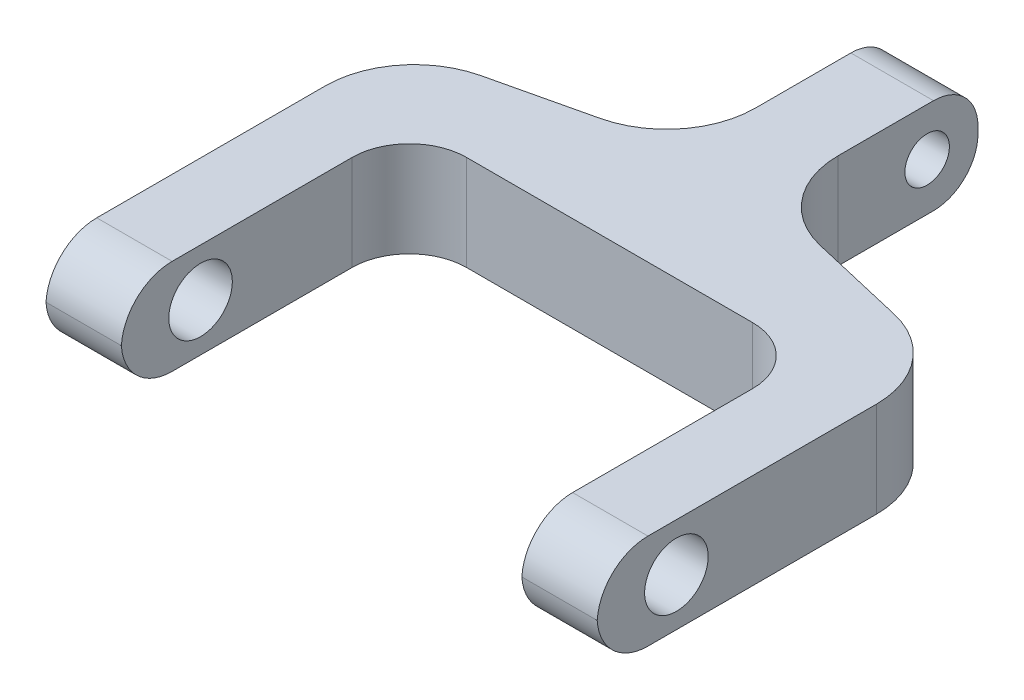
ISO-10303-21;
HEADER;
FILE_DESCRIPTION(('STEP AP214'),'2;1');
FILE_NAME('part.step','',(''),(''),'','','');
FILE_SCHEMA(('AUTOMOTIVE_DESIGN { 1 0 10303 214 1 1 1 1 }'));
ENDSEC;
DATA;
#1=APPLICATION_CONTEXT('core data for automotive mechanical design processes');
#2=APPLICATION_PROTOCOL_DEFINITION('international standard','automotive_design',2000,#1);
#3=PRODUCT_CONTEXT('',#1,'mechanical');
#4=PRODUCT('Part','Part','',(#3));
#5=PRODUCT_RELATED_PRODUCT_CATEGORY('part','',(#4));
#6=PRODUCT_DEFINITION_FORMATION('','',#4);
#7=PRODUCT_DEFINITION_CONTEXT('part definition',#1,'design');
#8=PRODUCT_DEFINITION('design','',#6,#7);
#9=PRODUCT_DEFINITION_SHAPE('','',#8);
#10=(LENGTH_UNIT() NAMED_UNIT(*) SI_UNIT(.MILLI.,.METRE.));
#11=(NAMED_UNIT(*) PLANE_ANGLE_UNIT() SI_UNIT($,.RADIAN.));
#12=(NAMED_UNIT(*) SI_UNIT($,.STERADIAN.) SOLID_ANGLE_UNIT());
#13=UNCERTAINTY_MEASURE_WITH_UNIT(LENGTH_MEASURE(1.E-05),#10,'distance_accuracy_value','');
#14=(GEOMETRIC_REPRESENTATION_CONTEXT(3) GLOBAL_UNCERTAINTY_ASSIGNED_CONTEXT((#13)) GLOBAL_UNIT_ASSIGNED_CONTEXT((#10,
#11,#12)) REPRESENTATION_CONTEXT('',''));
#15=CARTESIAN_POINT('',(0.,0.,0.));
#16=DIRECTION('',(0.,0.,1.));
#17=DIRECTION('',(1.,0.,0.));
#18=AXIS2_PLACEMENT_3D('',#15,#16,#17);
#19=CARTESIAN_POINT('',(-225.,150.,387.871836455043));
#20=DIRECTION('',(0.,-1.,0.));
#21=DIRECTION('',(0.,0.,-1.));
#22=AXIS2_PLACEMENT_3D('',#19,#20,#21);
#23=PLANE('',#22);
#24=DIRECTION('',(0.,0.,1.));
#25=VECTOR('',#24,1.);
#26=CARTESIAN_POINT('',(-433.5539295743,150.,311.542784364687));
#27=LINE('',#26,#25);
#28=CARTESIAN_POINT('',(-433.5539295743,150.,311.542784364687));
#29=VERTEX_POINT('',#28);
#30=CARTESIAN_POINT('',(-433.5539295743,150.,671.030993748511));
#31=VERTEX_POINT('',#30);
#32=EDGE_CURVE('E264',#29,#31,#27,.T.);
#33=ORIENTED_EDGE('',*,*,#32,.T.);
#34=DIRECTION('',(-1.,0.,0.));
#35=VECTOR('',#34,1.);
#36=CARTESIAN_POINT('',(-315.,150.,671.030993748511));
#37=LINE('',#36,#35);
#38=CARTESIAN_POINT('',(-315.,150.,671.030993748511));
#39=VERTEX_POINT('',#38);
#40=EDGE_CURVE('E202',#31,#39,#37,.F.);
#41=ORIENTED_EDGE('',*,*,#40,.T.);
#42=DIRECTION('',(0.,0.,-1.));
#43=VECTOR('',#42,1.);
#44=CARTESIAN_POINT('',(-315.,150.,941.030993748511));
#45=LINE('',#44,#43);
#46=CARTESIAN_POINT('',(-315.,150.,387.871836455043));
#47=VERTEX_POINT('',#46);
#48=EDGE_CURVE('E195',#39,#47,#45,.T.);
#49=ORIENTED_EDGE('',*,*,#48,.T.);
#50=CARTESIAN_POINT('',(-225.,150.,387.871836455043));
#51=DIRECTION('',(0.,-1.,0.));
#52=DIRECTION('',(0.,0.,-1.));
#53=AXIS2_PLACEMENT_3D('',#50,#51,#52);
#54=CIRCLE('',#53,90.);
#55=CARTESIAN_POINT('',(-225.,150.,297.871836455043));
#56=VERTEX_POINT('',#55);
#57=EDGE_CURVE('E199',#47,#56,#54,.T.);
#58=ORIENTED_EDGE('',*,*,#57,.T.);
#59=DIRECTION('',(1.,0.,0.));
#60=VECTOR('',#59,1.);
#61=CARTESIAN_POINT('',(-225.,150.,297.871836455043));
#62=LINE('',#61,#60);
#63=CARTESIAN_POINT('',(225.,150.,297.871836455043));
#64=VERTEX_POINT('',#63);
#65=EDGE_CURVE('E223',#56,#64,#62,.T.);
#66=ORIENTED_EDGE('',*,*,#65,.T.);
#67=CARTESIAN_POINT('',(225.,150.,387.871836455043));
#68=DIRECTION('',(0.,-1.,0.));
#69=DIRECTION('',(0.,0.,-1.));
#70=AXIS2_PLACEMENT_3D('',#67,#68,#69);
#71=CIRCLE('',#70,89.9999999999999);
#72=CARTESIAN_POINT('',(315.,150.,387.871836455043));
#73=VERTEX_POINT('',#72);
#74=EDGE_CURVE('E226',#64,#73,#71,.T.);
#75=ORIENTED_EDGE('',*,*,#74,.T.);
#76=DIRECTION('',(0.,0.,1.));
#77=VECTOR('',#76,1.);
#78=CARTESIAN_POINT('',(315.,150.,387.871836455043));
#79=LINE('',#78,#77);
#80=CARTESIAN_POINT('',(315.,150.,671.030993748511));
#81=VERTEX_POINT('',#80);
#82=EDGE_CURVE('E232',#73,#81,#79,.T.);
#83=ORIENTED_EDGE('',*,*,#82,.T.);
#84=DIRECTION('',(-1.,0.,0.));
#85=VECTOR('',#84,1.);
#86=CARTESIAN_POINT('',(433.5539295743,150.,671.030993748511));
#87=LINE('',#86,#85);
#88=CARTESIAN_POINT('',(433.5539295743,150.,671.030993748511));
#89=VERTEX_POINT('',#88);
#90=EDGE_CURVE('E399',#81,#89,#87,.F.);
#91=ORIENTED_EDGE('',*,*,#90,.T.);
#92=DIRECTION('',(0.,0.,-1.));
#93=VECTOR('',#92,1.);
#94=CARTESIAN_POINT('',(433.5539295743,150.,941.030993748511));
#95=LINE('',#94,#93);
#96=CARTESIAN_POINT('',(433.5539295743,150.,311.542784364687));
#97=VERTEX_POINT('',#96);
#98=EDGE_CURVE('E236',#89,#97,#95,.T.);
#99=ORIENTED_EDGE('',*,*,#98,.T.);
#100=CARTESIAN_POINT('',(293.5539295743,150.,311.542784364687));
#101=DIRECTION('',(0.,1.,0.));
#102=DIRECTION('',(0.,0.,-1.));
#103=AXIS2_PLACEMENT_3D('',#100,#101,#102);
#104=CIRCLE('',#103,140.);
#105=CARTESIAN_POINT('',(325.418661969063,150.,175.217295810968));
#106=VERTEX_POINT('',#105);
#107=EDGE_CURVE('E239',#97,#106,#104,.T.);
#108=ORIENTED_EDGE('',*,*,#107,.T.);
#109=DIRECTION('',(-0.97375348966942,0.,-0.227605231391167));
#110=VECTOR('',#109,1.);
#111=CARTESIAN_POINT('',(173.135267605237,150.,139.622561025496));
#112=LINE('',#111,#110);
#113=CARTESIAN_POINT('',(173.135267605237,150.,139.622561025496));
#114=VERTEX_POINT('',#113);
#115=EDGE_CURVE('E242',#106,#114,#112,.T.);
#116=ORIENTED_EDGE('',*,*,#115,.T.);
#117=CARTESIAN_POINT('',(205.,150.,3.29707247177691));
#118=DIRECTION('',(0.,-1.,0.));
#119=DIRECTION('',(0.,0.,1.));
#120=AXIS2_PLACEMENT_3D('',#117,#118,#119);
#121=CIRCLE('',#120,140.);
#122=CARTESIAN_POINT('',(65.,150.,3.29707247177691));
#123=VERTEX_POINT('',#122);
#124=EDGE_CURVE('E245',#114,#123,#121,.T.);
#125=ORIENTED_EDGE('',*,*,#124,.T.);
#126=DIRECTION('',(0.,0.,-1.));
#127=VECTOR('',#126,1.);
#128=CARTESIAN_POINT('',(65.,150.,-276.702927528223));
#129=LINE('',#128,#127);
#130=CARTESIAN_POINT('',(65.,150.,-146.702927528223));
#131=VERTEX_POINT('',#130);
#132=EDGE_CURVE('E248',#123,#131,#129,.T.);
#133=ORIENTED_EDGE('',*,*,#132,.T.);
#134=DIRECTION('',(1.,0.,0.));
#135=VECTOR('',#134,1.);
#136=CARTESIAN_POINT('',(-65.,150.,-146.702927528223));
#137=LINE('',#136,#135);
#138=CARTESIAN_POINT('',(-65.,150.,-146.702927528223));
#139=VERTEX_POINT('',#138);
#140=EDGE_CURVE('E377',#131,#139,#137,.F.);
#141=ORIENTED_EDGE('',*,*,#140,.T.);
#142=DIRECTION('',(0.,0.,1.));
#143=VECTOR('',#142,1.);
#144=CARTESIAN_POINT('',(-65.,150.,3.29707247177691));
#145=LINE('',#144,#143);
#146=CARTESIAN_POINT('',(-65.,150.,3.2970724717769));
#147=VERTEX_POINT('',#146);
#148=EDGE_CURVE('E252',#139,#147,#145,.T.);
#149=ORIENTED_EDGE('',*,*,#148,.T.);
#150=CARTESIAN_POINT('',(-205.,150.,3.29707247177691));
#151=DIRECTION('',(0.,-1.,0.));
#152=DIRECTION('',(0.,0.,-1.));
#153=AXIS2_PLACEMENT_3D('',#150,#151,#152);
#154=CIRCLE('',#153,140.);
#155=CARTESIAN_POINT('',(-173.135267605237,150.,139.622561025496));
#156=VERTEX_POINT('',#155);
#157=EDGE_CURVE('E255',#147,#156,#154,.T.);
#158=ORIENTED_EDGE('',*,*,#157,.T.);
#159=DIRECTION('',(-0.97375348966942,0.,0.227605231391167));
#160=VECTOR('',#159,1.);
#161=CARTESIAN_POINT('',(-173.135267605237,150.,139.622561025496));
#162=LINE('',#161,#160);
#163=CARTESIAN_POINT('',(-325.418661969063,150.,175.217295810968));
#164=VERTEX_POINT('',#163);
#165=EDGE_CURVE('E258',#156,#164,#162,.T.);
#166=ORIENTED_EDGE('',*,*,#165,.T.);
#167=CARTESIAN_POINT('',(-293.5539295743,150.,311.542784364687));
#168=DIRECTION('',(0.,1.,0.));
#169=DIRECTION('',(0.,0.,1.));
#170=AXIS2_PLACEMENT_3D('',#167,#168,#169);
#171=CIRCLE('',#170,140.);
#172=EDGE_CURVE('E261',#164,#29,#171,.T.);
#173=ORIENTED_EDGE('',*,*,#172,.T.);
#174=EDGE_LOOP('',(#33,#41,#49,#58,#66,#75,#83,#91,#99,#108,#116,#125,#133,#141,#149,#158,#166,#173));
#175=FACE_BOUND('',#174,.T.);
#176=ADVANCED_FACE('F45',(#175),#23,.F.);
#177=CARTESIAN_POINT('',(-225.,0.,387.871836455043));
#178=DIRECTION('',(0.,-1.,0.));
#179=DIRECTION('',(0.,0.,-1.));
#180=AXIS2_PLACEMENT_3D('',#177,#178,#179);
#181=PLANE('',#180);
#182=DIRECTION('',(0.,0.,-1.));
#183=VECTOR('',#182,1.);
#184=CARTESIAN_POINT('',(-315.,0.,941.030993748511));
#185=LINE('',#184,#183);
#186=CARTESIAN_POINT('',(-315.,0.,671.030993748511));
#187=VERTEX_POINT('',#186);
#188=CARTESIAN_POINT('',(-315.,0.,387.871836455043));
#189=VERTEX_POINT('',#188);
#190=EDGE_CURVE('E212',#187,#189,#185,.T.);
#191=ORIENTED_EDGE('',*,*,#190,.F.);
#192=DIRECTION('',(1.,0.,0.));
#193=VECTOR('',#192,1.);
#194=CARTESIAN_POINT('',(-225.,0.,671.030993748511));
#195=LINE('',#194,#193);
#196=CARTESIAN_POINT('',(-433.5539295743,0.,671.030993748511));
#197=VERTEX_POINT('',#196);
#198=EDGE_CURVE('E389',#187,#197,#195,.F.);
#199=ORIENTED_EDGE('',*,*,#198,.T.);
#200=DIRECTION('',(0.,0.,1.));
#201=VECTOR('',#200,1.);
#202=CARTESIAN_POINT('',(-433.5539295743,0.,311.542784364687));
#203=LINE('',#202,#201);
#204=CARTESIAN_POINT('',(-433.5539295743,0.,311.542784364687));
#205=VERTEX_POINT('',#204);
#206=EDGE_CURVE('E206',#205,#197,#203,.T.);
#207=ORIENTED_EDGE('',*,*,#206,.F.);
#208=CARTESIAN_POINT('',(-293.5539295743,0.,311.542784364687));
#209=DIRECTION('',(0.,1.,0.));
#210=DIRECTION('',(0.,0.,1.));
#211=AXIS2_PLACEMENT_3D('',#208,#209,#210);
#212=CIRCLE('',#211,140.);
#213=CARTESIAN_POINT('',(-325.418661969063,0.,175.217295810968));
#214=VERTEX_POINT('',#213);
#215=EDGE_CURVE('E308',#214,#205,#212,.T.);
#216=ORIENTED_EDGE('',*,*,#215,.F.);
#217=DIRECTION('',(-0.97375348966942,0.,0.227605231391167));
#218=VECTOR('',#217,1.);
#219=CARTESIAN_POINT('',(-173.135267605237,0.,139.622561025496));
#220=LINE('',#219,#218);
#221=CARTESIAN_POINT('',(-173.135267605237,0.,139.622561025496));
#222=VERTEX_POINT('',#221);
#223=EDGE_CURVE('E305',#222,#214,#220,.T.);
#224=ORIENTED_EDGE('',*,*,#223,.F.);
#225=CARTESIAN_POINT('',(-205.,0.,3.29707247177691));
#226=DIRECTION('',(0.,-1.,0.));
#227=DIRECTION('',(0.,0.,-1.));
#228=AXIS2_PLACEMENT_3D('',#225,#226,#227);
#229=CIRCLE('',#228,140.);
#230=CARTESIAN_POINT('',(-65.,0.,3.2970724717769));
#231=VERTEX_POINT('',#230);
#232=EDGE_CURVE('E302',#231,#222,#229,.T.);
#233=ORIENTED_EDGE('',*,*,#232,.F.);
#234=DIRECTION('',(0.,0.,1.));
#235=VECTOR('',#234,1.);
#236=CARTESIAN_POINT('',(-65.,0.,3.29707247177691));
#237=LINE('',#236,#235);
#238=CARTESIAN_POINT('',(-65.,0.,-146.702927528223));
#239=VERTEX_POINT('',#238);
#240=EDGE_CURVE('E299',#239,#231,#237,.T.);
#241=ORIENTED_EDGE('',*,*,#240,.F.);
#242=DIRECTION('',(-1.,0.,0.));
#243=VECTOR('',#242,1.);
#244=CARTESIAN_POINT('',(-225.,0.,-146.702927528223));
#245=LINE('',#244,#243);
#246=CARTESIAN_POINT('',(65.,0.,-146.702927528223));
#247=VERTEX_POINT('',#246);
#248=EDGE_CURVE('E368',#239,#247,#245,.F.);
#249=ORIENTED_EDGE('',*,*,#248,.T.);
#250=DIRECTION('',(0.,0.,-1.));
#251=VECTOR('',#250,1.);
#252=CARTESIAN_POINT('',(65.,0.,-276.702927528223));
#253=LINE('',#252,#251);
#254=CARTESIAN_POINT('',(65.,0.,3.29707247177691));
#255=VERTEX_POINT('',#254);
#256=EDGE_CURVE('E295',#255,#247,#253,.T.);
#257=ORIENTED_EDGE('',*,*,#256,.F.);
#258=CARTESIAN_POINT('',(205.,0.,3.29707247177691));
#259=DIRECTION('',(0.,-1.,0.));
#260=DIRECTION('',(0.,0.,1.));
#261=AXIS2_PLACEMENT_3D('',#258,#259,#260);
#262=CIRCLE('',#261,140.);
#263=CARTESIAN_POINT('',(173.135267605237,0.,139.622561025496));
#264=VERTEX_POINT('',#263);
#265=EDGE_CURVE('E292',#264,#255,#262,.T.);
#266=ORIENTED_EDGE('',*,*,#265,.F.);
#267=DIRECTION('',(-0.97375348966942,0.,-0.227605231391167));
#268=VECTOR('',#267,1.);
#269=CARTESIAN_POINT('',(173.135267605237,0.,139.622561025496));
#270=LINE('',#269,#268);
#271=CARTESIAN_POINT('',(325.418661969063,0.,175.217295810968));
#272=VERTEX_POINT('',#271);
#273=EDGE_CURVE('E289',#272,#264,#270,.T.);
#274=ORIENTED_EDGE('',*,*,#273,.F.);
#275=CARTESIAN_POINT('',(293.5539295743,0.,311.542784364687));
#276=DIRECTION('',(0.,1.,0.));
#277=DIRECTION('',(0.,0.,-1.));
#278=AXIS2_PLACEMENT_3D('',#275,#276,#277);
#279=CIRCLE('',#278,140.);
#280=CARTESIAN_POINT('',(433.5539295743,0.,311.542784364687));
#281=VERTEX_POINT('',#280);
#282=EDGE_CURVE('E286',#281,#272,#279,.T.);
#283=ORIENTED_EDGE('',*,*,#282,.F.);
#284=DIRECTION('',(0.,0.,-1.));
#285=VECTOR('',#284,1.);
#286=CARTESIAN_POINT('',(433.5539295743,0.,941.030993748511));
#287=LINE('',#286,#285);
#288=CARTESIAN_POINT('',(433.5539295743,0.,671.030993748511));
#289=VERTEX_POINT('',#288);
#290=EDGE_CURVE('E283',#289,#281,#287,.T.);
#291=ORIENTED_EDGE('',*,*,#290,.F.);
#292=DIRECTION('',(1.,0.,0.));
#293=VECTOR('',#292,1.);
#294=CARTESIAN_POINT('',(-225.,0.,671.030993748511));
#295=LINE('',#294,#293);
#296=CARTESIAN_POINT('',(315.,0.,671.030993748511));
#297=VERTEX_POINT('',#296);
#298=EDGE_CURVE('E386',#289,#297,#295,.F.);
#299=ORIENTED_EDGE('',*,*,#298,.T.);
#300=DIRECTION('',(0.,0.,1.));
#301=VECTOR('',#300,1.);
#302=CARTESIAN_POINT('',(315.,0.,387.871836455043));
#303=LINE('',#302,#301);
#304=CARTESIAN_POINT('',(315.,0.,387.871836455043));
#305=VERTEX_POINT('',#304);
#306=EDGE_CURVE('E280',#305,#297,#303,.T.);
#307=ORIENTED_EDGE('',*,*,#306,.F.);
#308=CARTESIAN_POINT('',(225.,0.,387.871836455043));
#309=DIRECTION('',(0.,-1.,0.));
#310=DIRECTION('',(0.,0.,-1.));
#311=AXIS2_PLACEMENT_3D('',#308,#309,#310);
#312=CIRCLE('',#311,89.9999999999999);
#313=CARTESIAN_POINT('',(225.,0.,297.871836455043));
#314=VERTEX_POINT('',#313);
#315=EDGE_CURVE('E277',#314,#305,#312,.T.);
#316=ORIENTED_EDGE('',*,*,#315,.F.);
#317=DIRECTION('',(1.,0.,0.));
#318=VECTOR('',#317,1.);
#319=CARTESIAN_POINT('',(-225.,0.,297.871836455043));
#320=LINE('',#319,#318);
#321=CARTESIAN_POINT('',(-225.,0.,297.871836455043));
#322=VERTEX_POINT('',#321);
#323=EDGE_CURVE('E274',#322,#314,#320,.T.);
#324=ORIENTED_EDGE('',*,*,#323,.F.);
#325=CARTESIAN_POINT('',(-225.,0.,387.871836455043));
#326=DIRECTION('',(0.,-1.,0.));
#327=DIRECTION('',(0.,0.,-1.));
#328=AXIS2_PLACEMENT_3D('',#325,#326,#327);
#329=CIRCLE('',#328,90.);
#330=EDGE_CURVE('E270',#189,#322,#329,.T.);
#331=ORIENTED_EDGE('',*,*,#330,.F.);
#332=EDGE_LOOP('',(#191,#199,#207,#216,#224,#233,#241,#249,#257,#266,#274,#283,#291,#299,#307,
#316,#324,#331));
#333=FACE_BOUND('',#332,.T.);
#334=ADVANCED_FACE('F435',(#333),#181,.T.);
#335=CARTESIAN_POINT('',(-315.,150.,941.030993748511));
#336=DIRECTION('',(-1.,0.,0.));
#337=DIRECTION('',(0.,0.,1.));
#338=AXIS2_PLACEMENT_3D('',#335,#336,#337);
#339=PLANE('',#338);
#340=CARTESIAN_POINT('',(-315.,75.,626.286889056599));
#341=DIRECTION('',(-1.,0.,0.));
#342=DIRECTION('',(0.,0.,1.));
#343=AXIS2_PLACEMENT_3D('',#340,#341,#342);
#344=CIRCLE('',#343,50.);
#345=CARTESIAN_POINT('',(-315.,75.,576.286889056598));
#346=VERTEX_POINT('',#345);
#347=EDGE_CURVE('E526',#346,#346,#344,.T.);
#348=ORIENTED_EDGE('',*,*,#347,.T.);
#349=EDGE_LOOP('',(#348));
#350=FACE_BOUND('',#349,.T.);
#351=CARTESIAN_POINT('',(-315.,70.,671.030993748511));
#352=DIRECTION('',(-1.,0.,0.));
#353=DIRECTION('',(0.,0.,1.));
#354=AXIS2_PLACEMENT_3D('',#351,#352,#353);
#355=CIRCLE('',#354,80.);
#356=CARTESIAN_POINT('',(-315.,75.,750.874590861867));
#357=VERTEX_POINT('',#356);
#358=EDGE_CURVE('E380',#39,#357,#355,.F.);
#359=ORIENTED_EDGE('',*,*,#358,.T.);
#360=CARTESIAN_POINT('',(-315.,80.,671.030993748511));
#361=DIRECTION('',(-1.,0.,0.));
#362=DIRECTION('',(0.,0.,1.));
#363=AXIS2_PLACEMENT_3D('',#360,#361,#362);
#364=CIRCLE('',#363,80.);
#365=EDGE_CURVE('E383',#357,#187,#364,.F.);
#366=ORIENTED_EDGE('',*,*,#365,.T.);
#367=ORIENTED_EDGE('',*,*,#190,.T.);
#368=DIRECTION('',(0.,-1.,0.));
#369=VECTOR('',#368,1.);
#370=CARTESIAN_POINT('',(-315.,150.,387.871836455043));
#371=LINE('',#370,#369);
#372=EDGE_CURVE('E209',#47,#189,#371,.T.);
#373=ORIENTED_EDGE('',*,*,#372,.F.);
#374=ORIENTED_EDGE('',*,*,#48,.F.);
#375=EDGE_LOOP('',(#359,#366,#367,#373,#374));
#376=FACE_BOUND('',#375,.T.);
#377=ADVANCED_FACE('F210',(#350,#376),#339,.F.);
#378=CARTESIAN_POINT('',(315.,150.,387.871836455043));
#379=DIRECTION('',(1.,0.,0.));
#380=DIRECTION('',(0.,0.,-1.));
#381=AXIS2_PLACEMENT_3D('',#378,#379,#380);
#382=PLANE('',#381);
#383=CARTESIAN_POINT('',(315.,75.,626.286889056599));
#384=DIRECTION('',(1.,0.,0.));
#385=DIRECTION('',(0.,0.,-1.));
#386=AXIS2_PLACEMENT_3D('',#383,#384,#385);
#387=CIRCLE('',#386,50.);
#388=CARTESIAN_POINT('',(315.,75.,576.286889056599));
#389=VERTEX_POINT('',#388);
#390=EDGE_CURVE('E523',#389,#389,#387,.T.);
#391=ORIENTED_EDGE('',*,*,#390,.T.);
#392=EDGE_LOOP('',(#391));
#393=FACE_BOUND('',#392,.T.);
#394=CARTESIAN_POINT('',(315.,80.,671.030993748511));
#395=DIRECTION('',(1.,0.,0.));
#396=DIRECTION('',(0.,0.,-1.));
#397=AXIS2_PLACEMENT_3D('',#394,#395,#396);
#398=CIRCLE('',#397,80.);
#399=CARTESIAN_POINT('',(315.,75.,750.874590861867));
#400=VERTEX_POINT('',#399);
#401=EDGE_CURVE('E69',#297,#400,#398,.F.);
#402=ORIENTED_EDGE('',*,*,#401,.T.);
#403=CARTESIAN_POINT('',(315.,70.,671.030993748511));
#404=DIRECTION('',(1.,0.,0.));
#405=DIRECTION('',(0.,0.,-1.));
#406=AXIS2_PLACEMENT_3D('',#403,#404,#405);
#407=CIRCLE('',#406,80.);
#408=EDGE_CURVE('E407',#400,#81,#407,.F.);
#409=ORIENTED_EDGE('',*,*,#408,.T.);
#410=ORIENTED_EDGE('',*,*,#82,.F.);
#411=DIRECTION('',(0.,-1.,0.));
#412=VECTOR('',#411,1.);
#413=CARTESIAN_POINT('',(315.,150.,387.871836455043));
#414=LINE('',#413,#412);
#415=EDGE_CURVE('E345',#73,#305,#414,.T.);
#416=ORIENTED_EDGE('',*,*,#415,.T.);
#417=ORIENTED_EDGE('',*,*,#306,.T.);
#418=EDGE_LOOP('',(#402,#409,#410,#416,#417));
#419=FACE_BOUND('',#418,.T.);
#420=ADVANCED_FACE('F452',(#393,#419),#382,.F.);
#421=CARTESIAN_POINT('',(433.5539295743,150.,941.030993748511));
#422=DIRECTION('',(-1.,0.,0.));
#423=DIRECTION('',(0.,0.,1.));
#424=AXIS2_PLACEMENT_3D('',#421,#422,#423);
#425=PLANE('',#424);
#426=CARTESIAN_POINT('',(433.5539295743,75.,626.286889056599));
#427=DIRECTION('',(1.,0.,0.));
#428=DIRECTION('',(0.,0.,-1.));
#429=AXIS2_PLACEMENT_3D('',#426,#427,#428);
#430=CIRCLE('',#429,50.);
#431=CARTESIAN_POINT('',(433.5539295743,75.,576.286889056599));
#432=VERTEX_POINT('',#431);
#433=EDGE_CURVE('E535',#432,#432,#430,.T.);
#434=ORIENTED_EDGE('',*,*,#433,.F.);
#435=EDGE_LOOP('',(#434));
#436=FACE_BOUND('',#435,.T.);
#437=ORIENTED_EDGE('',*,*,#98,.F.);
#438=CARTESIAN_POINT('',(433.5539295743,70.,671.030993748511));
#439=DIRECTION('',(-1.,0.,0.));
#440=DIRECTION('',(0.,0.,1.));
#441=AXIS2_PLACEMENT_3D('',#438,#439,#440);
#442=CIRCLE('',#441,80.);
#443=CARTESIAN_POINT('',(433.5539295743,75.,750.874590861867));
#444=VERTEX_POINT('',#443);
#445=EDGE_CURVE('E11',#89,#444,#442,.F.);
#446=ORIENTED_EDGE('',*,*,#445,.T.);
#447=CARTESIAN_POINT('',(433.5539295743,80.,671.030993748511));
#448=DIRECTION('',(-1.,0.,0.));
#449=DIRECTION('',(0.,0.,1.));
#450=AXIS2_PLACEMENT_3D('',#447,#448,#449);
#451=CIRCLE('',#450,80.);
#452=EDGE_CURVE('E55',#444,#289,#451,.F.);
#453=ORIENTED_EDGE('',*,*,#452,.T.);
#454=ORIENTED_EDGE('',*,*,#290,.T.);
#455=DIRECTION('',(0.,-1.,0.));
#456=VECTOR('',#455,1.);
#457=CARTESIAN_POINT('',(433.5539295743,150.,311.542784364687));
#458=LINE('',#457,#456);
#459=EDGE_CURVE('E341',#97,#281,#458,.T.);
#460=ORIENTED_EDGE('',*,*,#459,.F.);
#461=EDGE_LOOP('',(#437,#446,#453,#454,#460));
#462=FACE_BOUND('',#461,.T.);
#463=ADVANCED_FACE('F431',(#436,#462),#425,.F.);
#464=CARTESIAN_POINT('',(-433.5539295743,150.,311.542784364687));
#465=DIRECTION('',(1.,0.,0.));
#466=DIRECTION('',(0.,0.,-1.));
#467=AXIS2_PLACEMENT_3D('',#464,#465,#466);
#468=PLANE('',#467);
#469=CARTESIAN_POINT('',(-433.5539295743,75.,626.286889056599));
#470=DIRECTION('',(1.,0.,0.));
#471=DIRECTION('',(0.,0.,-1.));
#472=AXIS2_PLACEMENT_3D('',#469,#470,#471);
#473=CIRCLE('',#472,50.);
#474=CARTESIAN_POINT('',(-433.5539295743,75.,576.286889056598));
#475=VERTEX_POINT('',#474);
#476=EDGE_CURVE('E527',#475,#475,#473,.T.);
#477=ORIENTED_EDGE('',*,*,#476,.T.);
#478=EDGE_LOOP('',(#477));
#479=FACE_BOUND('',#478,.T.);
#480=ORIENTED_EDGE('',*,*,#206,.T.);
#481=CARTESIAN_POINT('',(-433.5539295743,80.,671.030993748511));
#482=DIRECTION('',(1.,0.,0.));
#483=DIRECTION('',(0.,0.,-1.));
#484=AXIS2_PLACEMENT_3D('',#481,#482,#483);
#485=CIRCLE('',#484,80.);
#486=CARTESIAN_POINT('',(-433.5539295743,75.,750.874590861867));
#487=VERTEX_POINT('',#486);
#488=EDGE_CURVE('E396',#197,#487,#485,.F.);
#489=ORIENTED_EDGE('',*,*,#488,.T.);
#490=CARTESIAN_POINT('',(-433.5539295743,70.,671.030993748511));
#491=DIRECTION('',(1.,0.,0.));
#492=DIRECTION('',(0.,0.,-1.));
#493=AXIS2_PLACEMENT_3D('',#490,#491,#492);
#494=CIRCLE('',#493,80.);
#495=EDGE_CURVE('E393',#487,#31,#494,.F.);
#496=ORIENTED_EDGE('',*,*,#495,.T.);
#497=ORIENTED_EDGE('',*,*,#32,.F.);
#498=DIRECTION('',(0.,-1.,0.));
#499=VECTOR('',#498,1.);
#500=CARTESIAN_POINT('',(-433.5539295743,150.,311.542784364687));
#501=LINE('',#500,#499);
#502=EDGE_CURVE('E267',#29,#205,#501,.T.);
#503=ORIENTED_EDGE('',*,*,#502,.T.);
#504=EDGE_LOOP('',(#480,#489,#496,#497,#503));
#505=FACE_BOUND('',#504,.T.);
#506=ADVANCED_FACE('F480',(#479,#505),#468,.F.);
#507=CARTESIAN_POINT('',(65.,150.,-276.702927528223));
#508=DIRECTION('',(-1.,0.,0.));
#509=DIRECTION('',(0.,0.,1.));
#510=AXIS2_PLACEMENT_3D('',#507,#508,#509);
#511=PLANE('',#510);
#512=CARTESIAN_POINT('',(65.,75.,-136.702927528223));
#513=DIRECTION('',(-1.,0.,0.));
#514=DIRECTION('',(0.,0.,1.));
#515=AXIS2_PLACEMENT_3D('',#512,#513,#514);
#516=CIRCLE('',#515,35.);
#517=CARTESIAN_POINT('',(65.,75.,-101.702927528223));
#518=VERTEX_POINT('',#517);
#519=EDGE_CURVE('E271',#518,#518,#516,.F.);
#520=ORIENTED_EDGE('',*,*,#519,.F.);
#521=EDGE_LOOP('',(#520));
#522=FACE_BOUND('',#521,.T.);
#523=ORIENTED_EDGE('',*,*,#256,.T.);
#524=CARTESIAN_POINT('',(65.,70.,-146.702927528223));
#525=DIRECTION('',(-1.,0.,0.));
#526=DIRECTION('',(0.,0.,1.));
#527=AXIS2_PLACEMENT_3D('',#524,#525,#526);
#528=CIRCLE('',#527,70.);
#529=CARTESIAN_POINT('',(65.,70.,-216.702927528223));
#530=VERTEX_POINT('',#529);
#531=EDGE_CURVE('E374',#247,#530,#528,.F.);
#532=ORIENTED_EDGE('',*,*,#531,.T.);
#533=DIRECTION('',(0.,-1.,0.));
#534=VECTOR('',#533,1.);
#535=CARTESIAN_POINT('',(65.,150.,-216.702927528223));
#536=LINE('',#535,#534);
#537=CARTESIAN_POINT('',(65.,80.,-216.702927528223));
#538=VERTEX_POINT('',#537);
#539=EDGE_CURVE('E414',#538,#530,#536,.T.);
#540=ORIENTED_EDGE('',*,*,#539,.F.);
#541=CARTESIAN_POINT('',(65.,80.,-146.702927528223));
#542=DIRECTION('',(-1.,0.,0.));
#543=DIRECTION('',(0.,0.,1.));
#544=AXIS2_PLACEMENT_3D('',#541,#542,#543);
#545=CIRCLE('',#544,70.);
#546=EDGE_CURVE('E371',#538,#131,#545,.F.);
#547=ORIENTED_EDGE('',*,*,#546,.T.);
#548=ORIENTED_EDGE('',*,*,#132,.F.);
#549=DIRECTION('',(0.,-1.,0.));
#550=VECTOR('',#549,1.);
#551=CARTESIAN_POINT('',(65.,150.,3.29707247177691));
#552=LINE('',#551,#550);
#553=EDGE_CURVE('E329',#123,#255,#552,.T.);
#554=ORIENTED_EDGE('',*,*,#553,.T.);
#555=EDGE_LOOP('',(#523,#532,#540,#547,#548,#554));
#556=FACE_BOUND('',#555,.T.);
#557=ADVANCED_FACE('F483',(#522,#556),#511,.F.);
#558=CARTESIAN_POINT('',(-65.,150.,3.29707247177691));
#559=DIRECTION('',(1.,0.,0.));
#560=DIRECTION('',(0.,0.,-1.));
#561=AXIS2_PLACEMENT_3D('',#558,#559,#560);
#562=PLANE('',#561);
#563=CARTESIAN_POINT('',(-65.,75.,-136.702927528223));
#564=DIRECTION('',(-1.,0.,0.));
#565=DIRECTION('',(0.,0.,1.));
#566=AXIS2_PLACEMENT_3D('',#563,#564,#565);
#567=CIRCLE('',#566,35.);
#568=CARTESIAN_POINT('',(-65.,75.,-101.702927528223));
#569=VERTEX_POINT('',#568);
#570=EDGE_CURVE('E532',#569,#569,#567,.T.);
#571=ORIENTED_EDGE('',*,*,#570,.F.);
#572=EDGE_LOOP('',(#571));
#573=FACE_BOUND('',#572,.T.);
#574=DIRECTION('',(0.,1.,0.));
#575=VECTOR('',#574,1.);
#576=CARTESIAN_POINT('',(-65.,150.,-216.702927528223));
#577=LINE('',#576,#575);
#578=CARTESIAN_POINT('',(-65.,70.,-216.702927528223));
#579=VERTEX_POINT('',#578);
#580=CARTESIAN_POINT('',(-65.,80.,-216.702927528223));
#581=VERTEX_POINT('',#580);
#582=EDGE_CURVE('E421',#579,#581,#577,.T.);
#583=ORIENTED_EDGE('',*,*,#582,.F.);
#584=CARTESIAN_POINT('',(-65.,70.,-146.702927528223));
#585=DIRECTION('',(1.,0.,0.));
#586=DIRECTION('',(0.,0.,-1.));
#587=AXIS2_PLACEMENT_3D('',#584,#585,#586);
#588=CIRCLE('',#587,70.);
#589=EDGE_CURVE('E365',#579,#239,#588,.F.);
#590=ORIENTED_EDGE('',*,*,#589,.T.);
#591=ORIENTED_EDGE('',*,*,#240,.T.);
#592=DIRECTION('',(0.,-1.,0.));
#593=VECTOR('',#592,1.);
#594=CARTESIAN_POINT('',(-65.,150.,3.2970724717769));
#595=LINE('',#594,#593);
#596=EDGE_CURVE('E325',#147,#231,#595,.T.);
#597=ORIENTED_EDGE('',*,*,#596,.F.);
#598=ORIENTED_EDGE('',*,*,#148,.F.);
#599=CARTESIAN_POINT('',(-65.,80.,-146.702927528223));
#600=DIRECTION('',(1.,0.,0.));
#601=DIRECTION('',(0.,0.,-1.));
#602=AXIS2_PLACEMENT_3D('',#599,#600,#601);
#603=CIRCLE('',#602,70.);
#604=EDGE_CURVE('E362',#139,#581,#603,.F.);
#605=ORIENTED_EDGE('',*,*,#604,.T.);
#606=EDGE_LOOP('',(#583,#590,#591,#597,#598,#605));
#607=FACE_BOUND('',#606,.T.);
#608=ADVANCED_FACE('F467',(#573,#607),#562,.F.);
#609=CARTESIAN_POINT('',(-225.,150.,387.871836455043));
#610=DIRECTION('',(0.,-1.,0.));
#611=DIRECTION('',(0.,0.,-1.));
#612=AXIS2_PLACEMENT_3D('',#609,#610,#611);
#613=CYLINDRICAL_SURFACE('',#612,90.);
#614=ORIENTED_EDGE('',*,*,#330,.T.);
#615=DIRECTION('',(0.,-1.,0.));
#616=VECTOR('',#615,1.);
#617=CARTESIAN_POINT('',(-225.,150.,297.871836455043));
#618=LINE('',#617,#616);
#619=EDGE_CURVE('E217',#56,#322,#618,.T.);
#620=ORIENTED_EDGE('',*,*,#619,.F.);
#621=ORIENTED_EDGE('',*,*,#57,.F.);
#622=ORIENTED_EDGE('',*,*,#372,.T.);
#623=EDGE_LOOP('',(#614,#620,#621,#622));
#624=FACE_BOUND('',#623,.T.);
#625=ADVANCED_FACE('F219',(#624),#613,.F.);
#626=CARTESIAN_POINT('',(-225.,150.,297.871836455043));
#627=DIRECTION('',(0.,0.,-1.));
#628=DIRECTION('',(-1.,0.,0.));
#629=AXIS2_PLACEMENT_3D('',#626,#627,#628);
#630=PLANE('',#629);
#631=ORIENTED_EDGE('',*,*,#323,.T.);
#632=DIRECTION('',(0.,-1.,0.));
#633=VECTOR('',#632,1.);
#634=CARTESIAN_POINT('',(225.,150.,297.871836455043));
#635=LINE('',#634,#633);
#636=EDGE_CURVE('E349',#64,#314,#635,.T.);
#637=ORIENTED_EDGE('',*,*,#636,.F.);
#638=ORIENTED_EDGE('',*,*,#65,.F.);
#639=ORIENTED_EDGE('',*,*,#619,.T.);
#640=EDGE_LOOP('',(#631,#637,#638,#639));
#641=FACE_BOUND('',#640,.T.);
#642=ADVANCED_FACE('F459',(#641),#630,.F.);
#643=CARTESIAN_POINT('',(225.,150.,387.871836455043));
#644=DIRECTION('',(0.,-1.,0.));
#645=DIRECTION('',(0.,0.,-1.));
#646=AXIS2_PLACEMENT_3D('',#643,#644,#645);
#647=CYLINDRICAL_SURFACE('',#646,89.9999999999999);
#648=ORIENTED_EDGE('',*,*,#315,.T.);
#649=ORIENTED_EDGE('',*,*,#415,.F.);
#650=ORIENTED_EDGE('',*,*,#74,.F.);
#651=ORIENTED_EDGE('',*,*,#636,.T.);
#652=EDGE_LOOP('',(#648,#649,#650,#651));
#653=FACE_BOUND('',#652,.T.);
#654=ADVANCED_FACE('F456',(#653),#647,.F.);
#655=CARTESIAN_POINT('',(293.5539295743,150.,311.542784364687));
#656=DIRECTION('',(0.,-1.,0.));
#657=DIRECTION('',(0.,0.,-1.));
#658=AXIS2_PLACEMENT_3D('',#655,#656,#657);
#659=CYLINDRICAL_SURFACE('',#658,140.);
#660=ORIENTED_EDGE('',*,*,#282,.T.);
#661=DIRECTION('',(0.,-1.,0.));
#662=VECTOR('',#661,1.);
#663=CARTESIAN_POINT('',(325.418661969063,150.,175.217295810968));
#664=LINE('',#663,#662);
#665=EDGE_CURVE('E337',#106,#272,#664,.T.);
#666=ORIENTED_EDGE('',*,*,#665,.F.);
#667=ORIENTED_EDGE('',*,*,#107,.F.);
#668=ORIENTED_EDGE('',*,*,#459,.T.);
#669=EDGE_LOOP('',(#660,#666,#667,#668));
#670=FACE_BOUND('',#669,.T.);
#671=ADVANCED_FACE('F441',(#670),#659,.T.);
#672=CARTESIAN_POINT('',(173.135267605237,150.,139.622561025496));
#673=DIRECTION('',(-0.227605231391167,0.,0.97375348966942));
#674=DIRECTION('',(0.97375348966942,0.,0.227605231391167));
#675=AXIS2_PLACEMENT_3D('',#672,#673,#674);
#676=PLANE('',#675);
#677=ORIENTED_EDGE('',*,*,#273,.T.);
#678=DIRECTION('',(0.,-1.,0.));
#679=VECTOR('',#678,1.);
#680=CARTESIAN_POINT('',(173.135267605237,150.,139.622561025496));
#681=LINE('',#680,#679);
#682=EDGE_CURVE('E333',#114,#264,#681,.T.);
#683=ORIENTED_EDGE('',*,*,#682,.F.);
#684=ORIENTED_EDGE('',*,*,#115,.F.);
#685=ORIENTED_EDGE('',*,*,#665,.T.);
#686=EDGE_LOOP('',(#677,#683,#684,#685));
#687=FACE_BOUND('',#686,.T.);
#688=ADVANCED_FACE('F445',(#687),#676,.F.);
#689=CARTESIAN_POINT('',(205.,150.,3.29707247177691));
#690=DIRECTION('',(0.,-1.,0.));
#691=DIRECTION('',(0.,0.,-1.));
#692=AXIS2_PLACEMENT_3D('',#689,#690,#691);
#693=CYLINDRICAL_SURFACE('',#692,140.);
#694=ORIENTED_EDGE('',*,*,#265,.T.);
#695=ORIENTED_EDGE('',*,*,#553,.F.);
#696=ORIENTED_EDGE('',*,*,#124,.F.);
#697=ORIENTED_EDGE('',*,*,#682,.T.);
#698=EDGE_LOOP('',(#694,#695,#696,#697));
#699=FACE_BOUND('',#698,.T.);
#700=ADVANCED_FACE('F496',(#699),#693,.F.);
#701=CARTESIAN_POINT('',(-205.,150.,3.29707247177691));
#702=DIRECTION('',(0.,-1.,0.));
#703=DIRECTION('',(0.,0.,-1.));
#704=AXIS2_PLACEMENT_3D('',#701,#702,#703);
#705=CYLINDRICAL_SURFACE('',#704,140.);
#706=ORIENTED_EDGE('',*,*,#232,.T.);
#707=DIRECTION('',(0.,-1.,0.));
#708=VECTOR('',#707,1.);
#709=CARTESIAN_POINT('',(-173.135267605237,150.,139.622561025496));
#710=LINE('',#709,#708);
#711=EDGE_CURVE('E321',#156,#222,#710,.T.);
#712=ORIENTED_EDGE('',*,*,#711,.F.);
#713=ORIENTED_EDGE('',*,*,#157,.F.);
#714=ORIENTED_EDGE('',*,*,#596,.T.);
#715=EDGE_LOOP('',(#706,#712,#713,#714));
#716=FACE_BOUND('',#715,.T.);
#717=ADVANCED_FACE('F492',(#716),#705,.F.);
#718=CARTESIAN_POINT('',(-173.135267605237,150.,139.622561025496));
#719=DIRECTION('',(0.227605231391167,0.,0.97375348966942));
#720=DIRECTION('',(0.97375348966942,0.,-0.227605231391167));
#721=AXIS2_PLACEMENT_3D('',#718,#719,#720);
#722=PLANE('',#721);
#723=ORIENTED_EDGE('',*,*,#223,.T.);
#724=DIRECTION('',(0.,-1.,0.));
#725=VECTOR('',#724,1.);
#726=CARTESIAN_POINT('',(-325.418661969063,150.,175.217295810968));
#727=LINE('',#726,#725);
#728=EDGE_CURVE('E317',#164,#214,#727,.T.);
#729=ORIENTED_EDGE('',*,*,#728,.F.);
#730=ORIENTED_EDGE('',*,*,#165,.F.);
#731=ORIENTED_EDGE('',*,*,#711,.T.);
#732=EDGE_LOOP('',(#723,#729,#730,#731));
#733=FACE_BOUND('',#732,.T.);
#734=ADVANCED_FACE('F488',(#733),#722,.F.);
#735=CARTESIAN_POINT('',(-293.5539295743,150.,311.542784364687));
#736=DIRECTION('',(0.,-1.,0.));
#737=DIRECTION('',(0.,0.,-1.));
#738=AXIS2_PLACEMENT_3D('',#735,#736,#737);
#739=CYLINDRICAL_SURFACE('',#738,140.);
#740=ORIENTED_EDGE('',*,*,#215,.T.);
#741=ORIENTED_EDGE('',*,*,#502,.F.);
#742=ORIENTED_EDGE('',*,*,#172,.F.);
#743=ORIENTED_EDGE('',*,*,#728,.T.);
#744=EDGE_LOOP('',(#740,#741,#742,#743));
#745=FACE_BOUND('',#744,.T.);
#746=ADVANCED_FACE('F485',(#745),#739,.T.);
#747=CARTESIAN_POINT('',(433.5549295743,75.,-136.702927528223));
#748=DIRECTION('',(-1.,0.,0.));
#749=DIRECTION('',(0.,0.,1.));
#750=AXIS2_PLACEMENT_3D('',#747,#748,#749);
#751=CYLINDRICAL_SURFACE('',#750,35.);
#752=ORIENTED_EDGE('',*,*,#570,.T.);
#753=EDGE_LOOP('',(#752));
#754=FACE_BOUND('',#753,.T.);
#755=ORIENTED_EDGE('',*,*,#519,.T.);
#756=EDGE_LOOP('',(#755));
#757=FACE_BOUND('',#756,.T.);
#758=ADVANCED_FACE('F477',(#754,#757),#751,.F.);
#759=CARTESIAN_POINT('',(-433.5539295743,75.,626.286889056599));
#760=DIRECTION('',(1.,0.,0.));
#761=DIRECTION('',(0.,0.,-1.));
#762=AXIS2_PLACEMENT_3D('',#759,#760,#761);
#763=CYLINDRICAL_SURFACE('',#762,50.);
#764=CARTESIAN_POINT('',(-433.5539295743,75.,576.286889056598));
#765=CARTESIAN_POINT('',(-432.318992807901,75.,576.286889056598));
#766=CARTESIAN_POINT('',(-431.084056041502,75.,576.286889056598));
#767=CARTESIAN_POINT('',(-428.614182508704,75.,576.286889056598));
#768=CARTESIAN_POINT('',(-427.379245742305,75.,576.286889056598));
#769=CARTESIAN_POINT('',(-424.909372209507,75.,576.286889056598));
#770=CARTESIAN_POINT('',(-423.674435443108,75.,576.286889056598));
#771=CARTESIAN_POINT('',(-421.20456191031,75.,576.286889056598));
#772=CARTESIAN_POINT('',(-419.969625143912,75.,576.286889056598));
#773=CARTESIAN_POINT('',(-417.499751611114,75.,576.286889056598));
#774=CARTESIAN_POINT('',(-416.264814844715,75.,576.286889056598));
#775=CARTESIAN_POINT('',(-413.794941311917,75.,576.286889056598));
#776=CARTESIAN_POINT('',(-412.560004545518,75.,576.286889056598));
#777=CARTESIAN_POINT('',(-410.09013101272,75.,576.286889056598));
#778=CARTESIAN_POINT('',(-408.855194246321,75.,576.286889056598));
#779=CARTESIAN_POINT('',(-406.385320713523,75.,576.286889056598));
#780=CARTESIAN_POINT('',(-405.150383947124,75.,576.286889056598));
#781=CARTESIAN_POINT('',(-402.680510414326,75.,576.286889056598));
#782=CARTESIAN_POINT('',(-401.445573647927,75.,576.286889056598));
#783=CARTESIAN_POINT('',(-398.975700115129,75.,576.286889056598));
#784=CARTESIAN_POINT('',(-397.74076334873,75.,576.286889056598));
#785=CARTESIAN_POINT('',(-395.270889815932,75.,576.286889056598));
#786=CARTESIAN_POINT('',(-394.035953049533,75.,576.286889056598));
#787=CARTESIAN_POINT('',(-391.566079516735,75.,576.286889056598));
#788=CARTESIAN_POINT('',(-390.331142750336,75.,576.286889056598));
#789=CARTESIAN_POINT('',(-387.861269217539,75.,576.286889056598));
#790=CARTESIAN_POINT('',(-386.62633245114,75.,576.286889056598));
#791=CARTESIAN_POINT('',(-384.156458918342,75.,576.286889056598));
#792=CARTESIAN_POINT('',(-382.921522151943,75.,576.286889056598));
#793=CARTESIAN_POINT('',(-380.451648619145,75.,576.286889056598));
#794=CARTESIAN_POINT('',(-379.216711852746,75.,576.286889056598));
#795=CARTESIAN_POINT('',(-376.746838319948,75.,576.286889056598));
#796=CARTESIAN_POINT('',(-375.511901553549,75.,576.286889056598));
#797=CARTESIAN_POINT('',(-373.042028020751,75.,576.286889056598));
#798=CARTESIAN_POINT('',(-371.807091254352,75.,576.286889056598));
#799=CARTESIAN_POINT('',(-369.337217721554,75.,576.286889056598));
#800=CARTESIAN_POINT('',(-368.102280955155,75.,576.286889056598));
#801=CARTESIAN_POINT('',(-365.632407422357,75.,576.286889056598));
#802=CARTESIAN_POINT('',(-364.397470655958,75.,576.286889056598));
#803=CARTESIAN_POINT('',(-361.92759712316,75.,576.286889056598));
#804=CARTESIAN_POINT('',(-360.692660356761,75.,576.286889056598));
#805=CARTESIAN_POINT('',(-358.222786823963,75.,576.286889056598));
#806=CARTESIAN_POINT('',(-356.987850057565,75.,576.286889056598));
#807=CARTESIAN_POINT('',(-354.517976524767,75.,576.286889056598));
#808=CARTESIAN_POINT('',(-353.283039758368,75.,576.286889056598));
#809=CARTESIAN_POINT('',(-350.81316622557,75.,576.286889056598));
#810=CARTESIAN_POINT('',(-349.578229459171,75.,576.286889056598));
#811=CARTESIAN_POINT('',(-347.108355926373,75.,576.286889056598));
#812=CARTESIAN_POINT('',(-345.873419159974,75.,576.286889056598));
#813=CARTESIAN_POINT('',(-343.403545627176,75.,576.286889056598));
#814=CARTESIAN_POINT('',(-342.168608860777,75.,576.286889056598));
#815=CARTESIAN_POINT('',(-339.698735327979,75.,576.286889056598));
#816=CARTESIAN_POINT('',(-338.46379856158,75.,576.286889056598));
#817=CARTESIAN_POINT('',(-335.993925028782,75.,576.286889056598));
#818=CARTESIAN_POINT('',(-334.758988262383,75.,576.286889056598));
#819=CARTESIAN_POINT('',(-332.289114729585,75.,576.286889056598));
#820=CARTESIAN_POINT('',(-331.054177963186,75.,576.286889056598));
#821=CARTESIAN_POINT('',(-328.584304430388,75.,576.286889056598));
#822=CARTESIAN_POINT('',(-327.349367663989,75.,576.286889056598));
#823=CARTESIAN_POINT('',(-324.879494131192,75.,576.286889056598));
#824=CARTESIAN_POINT('',(-323.644557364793,75.,576.286889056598));
#825=CARTESIAN_POINT('',(-321.174683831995,75.,576.286889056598));
#826=CARTESIAN_POINT('',(-319.939747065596,75.,576.286889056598));
#827=CARTESIAN_POINT('',(-317.469873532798,75.,576.286889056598));
#828=CARTESIAN_POINT('',(-316.234936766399,75.,576.286889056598));
#829=CARTESIAN_POINT('',(-315.,75.,576.286889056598));
#830=B_SPLINE_CURVE_WITH_KNOTS('',3,(#764,#765,#766,#767,#768,#769,#770,#771,#772,#773,#774,
#775,#776,#777,#778,#779,#780,#781,#782,#783,#784,#785,#786,#787,#788,#789,#790,#791,#792,#793,
#794,#795,#796,#797,#798,#799,#800,#801,#802,#803,#804,#805,#806,#807,#808,#809,#810,#811,#812,
#813,#814,#815,#816,#817,#818,#819,#820,#821,#822,#823,#824,#825,#826,#827,#828,#829),
.UNSPECIFIED.,.F.,.F.,(4,2,2,2,2,2,2,2,2,2,2,2,2,2,2,2,2,2,2,2,2,2,2,2,2,2,2,2,2,2,2,2,4),(0.,
3.70481029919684,7.40962059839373,11.1144308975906,14.8192411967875,18.5240514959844,
22.2288617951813,25.9336720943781,29.638482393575,33.3432926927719,37.0481029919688,
40.7529132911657,44.4577235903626,48.1625338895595,51.8673441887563,55.5721544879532,
59.2769647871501,62.981775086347,66.6865853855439,70.3913956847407,74.0962059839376,
77.8010162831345,81.5058265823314,85.2106368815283,88.9154471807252,92.6202574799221,
96.325067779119,100.029878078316,103.734688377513,107.43949867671,111.144308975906,
114.849119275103,118.5539295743),.UNSPECIFIED.);
#831=EDGE_CURVE('BSEAM571',#475,#346,#830,.T.);
#832=ORIENTED_EDGE('',*,*,#476,.F.);
#833=ORIENTED_EDGE('',*,*,#347,.F.);
#834=ORIENTED_EDGE('',*,*,#831,.T.);
#835=ORIENTED_EDGE('',*,*,#831,.F.);
#836=EDGE_LOOP('',(#832,#834,#833,#835));
#837=FACE_BOUND('',#836,.T.);
#838=ADVANCED_FACE('F571',(#837),#763,.F.);
#839=CARTESIAN_POINT('',(433.5539295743,75.,576.286889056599));
#840=CARTESIAN_POINT('',(432.318992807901,75.,576.286889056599));
#841=CARTESIAN_POINT('',(431.084056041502,75.,576.286889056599));
#842=CARTESIAN_POINT('',(428.614182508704,75.,576.286889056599));
#843=CARTESIAN_POINT('',(427.379245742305,75.,576.286889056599));
#844=CARTESIAN_POINT('',(424.909372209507,75.,576.286889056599));
#845=CARTESIAN_POINT('',(423.674435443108,75.,576.286889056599));
#846=CARTESIAN_POINT('',(421.20456191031,75.,576.286889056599));
#847=CARTESIAN_POINT('',(419.969625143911,75.,576.286889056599));
#848=CARTESIAN_POINT('',(417.499751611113,75.,576.286889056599));
#849=CARTESIAN_POINT('',(416.264814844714,75.,576.286889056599));
#850=CARTESIAN_POINT('',(413.794941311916,75.,576.286889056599));
#851=CARTESIAN_POINT('',(412.560004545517,75.,576.286889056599));
#852=CARTESIAN_POINT('',(410.09013101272,75.,576.286889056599));
#853=CARTESIAN_POINT('',(408.855194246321,75.,576.286889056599));
#854=CARTESIAN_POINT('',(406.385320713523,75.,576.286889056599));
#855=CARTESIAN_POINT('',(405.150383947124,75.,576.286889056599));
#856=CARTESIAN_POINT('',(402.680510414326,75.,576.286889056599));
#857=CARTESIAN_POINT('',(401.445573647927,75.,576.286889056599));
#858=CARTESIAN_POINT('',(398.975700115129,75.,576.286889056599));
#859=CARTESIAN_POINT('',(397.74076334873,75.,576.286889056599));
#860=CARTESIAN_POINT('',(395.270889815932,75.,576.286889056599));
#861=CARTESIAN_POINT('',(394.035953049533,75.,576.286889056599));
#862=CARTESIAN_POINT('',(391.566079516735,75.,576.286889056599));
#863=CARTESIAN_POINT('',(390.331142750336,75.,576.286889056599));
#864=CARTESIAN_POINT('',(387.861269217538,75.,576.286889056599));
#865=CARTESIAN_POINT('',(386.626332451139,75.,576.286889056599));
#866=CARTESIAN_POINT('',(384.156458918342,75.,576.286889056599));
#867=CARTESIAN_POINT('',(382.921522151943,75.,576.286889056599));
#868=CARTESIAN_POINT('',(380.451648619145,75.,576.286889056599));
#869=CARTESIAN_POINT('',(379.216711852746,75.,576.286889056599));
#870=CARTESIAN_POINT('',(376.746838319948,75.,576.286889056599));
#871=CARTESIAN_POINT('',(375.511901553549,75.,576.286889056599));
#872=CARTESIAN_POINT('',(373.042028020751,75.,576.286889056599));
#873=CARTESIAN_POINT('',(371.807091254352,75.,576.286889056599));
#874=CARTESIAN_POINT('',(369.337217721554,75.,576.286889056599));
#875=CARTESIAN_POINT('',(368.102280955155,75.,576.286889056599));
#876=CARTESIAN_POINT('',(365.632407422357,75.,576.286889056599));
#877=CARTESIAN_POINT('',(364.397470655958,75.,576.286889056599));
#878=CARTESIAN_POINT('',(361.92759712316,75.,576.286889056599));
#879=CARTESIAN_POINT('',(360.692660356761,75.,576.286889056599));
#880=CARTESIAN_POINT('',(358.222786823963,75.,576.286889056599));
#881=CARTESIAN_POINT('',(356.987850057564,75.,576.286889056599));
#882=CARTESIAN_POINT('',(354.517976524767,75.,576.286889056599));
#883=CARTESIAN_POINT('',(353.283039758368,75.,576.286889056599));
#884=CARTESIAN_POINT('',(350.81316622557,75.,576.286889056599));
#885=CARTESIAN_POINT('',(349.578229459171,75.,576.286889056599));
#886=CARTESIAN_POINT('',(347.108355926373,75.,576.286889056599));
#887=CARTESIAN_POINT('',(345.873419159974,75.,576.286889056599));
#888=CARTESIAN_POINT('',(343.403545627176,75.,576.286889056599));
#889=CARTESIAN_POINT('',(342.168608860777,75.,576.286889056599));
#890=CARTESIAN_POINT('',(339.698735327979,75.,576.286889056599));
#891=CARTESIAN_POINT('',(338.46379856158,75.,576.286889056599));
#892=CARTESIAN_POINT('',(335.993925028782,75.,576.286889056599));
#893=CARTESIAN_POINT('',(334.758988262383,75.,576.286889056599));
#894=CARTESIAN_POINT('',(332.289114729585,75.,576.286889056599));
#895=CARTESIAN_POINT('',(331.054177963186,75.,576.286889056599));
#896=CARTESIAN_POINT('',(328.584304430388,75.,576.286889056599));
#897=CARTESIAN_POINT('',(327.34936766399,75.,576.286889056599));
#898=CARTESIAN_POINT('',(324.879494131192,75.,576.286889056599));
#899=CARTESIAN_POINT('',(323.644557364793,75.,576.286889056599));
#900=CARTESIAN_POINT('',(321.174683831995,75.,576.286889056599));
#901=CARTESIAN_POINT('',(319.939747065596,75.,576.286889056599));
#902=CARTESIAN_POINT('',(317.469873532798,75.,576.286889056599));
#903=CARTESIAN_POINT('',(316.234936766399,75.,576.286889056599));
#904=CARTESIAN_POINT('',(315.,75.,576.286889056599));
#905=B_SPLINE_CURVE_WITH_KNOTS('',3,(#839,#840,#841,#842,#843,#844,#845,#846,#847,#848,#849,
#850,#851,#852,#853,#854,#855,#856,#857,#858,#859,#860,#861,#862,#863,#864,#865,#866,#867,#868,
#869,#870,#871,#872,#873,#874,#875,#876,#877,#878,#879,#880,#881,#882,#883,#884,#885,#886,#887,
#888,#889,#890,#891,#892,#893,#894,#895,#896,#897,#898,#899,#900,#901,#902,#903,#904),
.UNSPECIFIED.,.F.,.F.,(4,2,2,2,2,2,2,2,2,2,2,2,2,2,2,2,2,2,2,2,2,2,2,2,2,2,2,2,2,2,2,2,4),(0.,
3.70481029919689,7.40962059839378,11.1144308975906,14.8192411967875,18.5240514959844,
22.2288617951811,25.933672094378,29.6384823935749,33.3432926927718,37.0481029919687,
40.7529132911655,44.4577235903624,48.1625338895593,51.8673441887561,55.5721544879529,
59.2769647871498,62.9817750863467,66.6865853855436,70.3913956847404,74.0962059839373,
77.8010162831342,81.505826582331,85.2106368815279,88.9154471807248,92.6202574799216,
96.3250677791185,100.029878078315,103.734688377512,107.439498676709,111.144308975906,
114.849119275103,118.5539295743),.UNSPECIFIED.);
#906=EDGE_CURVE('BSEAM569',#432,#389,#905,.T.);
#907=ORIENTED_EDGE('',*,*,#433,.T.);
#908=ORIENTED_EDGE('',*,*,#390,.F.);
#909=ORIENTED_EDGE('',*,*,#906,.T.);
#910=ORIENTED_EDGE('',*,*,#906,.F.);
#911=EDGE_LOOP('',(#907,#909,#908,#910));
#912=FACE_BOUND('',#911,.T.);
#913=ADVANCED_FACE('F569',(#912),#763,.F.);
#914=CARTESIAN_POINT('',(0.,0.,-216.702927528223));
#915=DIRECTION('',(0.,0.,-1.));
#916=DIRECTION('',(-1.,0.,0.));
#917=AXIS2_PLACEMENT_3D('',#914,#915,#916);
#918=PLANE('',#917);
#919=ORIENTED_EDGE('',*,*,#539,.T.);
#920=DIRECTION('',(-1.,0.,0.));
#921=VECTOR('',#920,1.);
#922=CARTESIAN_POINT('',(0.,70.,-216.702927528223));
#923=LINE('',#922,#921);
#924=EDGE_CURVE('E358',#530,#579,#923,.T.);
#925=ORIENTED_EDGE('',*,*,#924,.T.);
#926=ORIENTED_EDGE('',*,*,#582,.T.);
#927=DIRECTION('',(1.,0.,0.));
#928=VECTOR('',#927,1.);
#929=CARTESIAN_POINT('',(65.,80.,-216.702927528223));
#930=LINE('',#929,#928);
#931=EDGE_CURVE('E216',#581,#538,#930,.T.);
#932=ORIENTED_EDGE('',*,*,#931,.T.);
#933=EDGE_LOOP('',(#919,#925,#926,#932));
#934=FACE_BOUND('',#933,.T.);
#935=ADVANCED_FACE('F557',(#934),#918,.T.);
#936=CARTESIAN_POINT('',(0.,70.,-146.702927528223));
#937=DIRECTION('',(-1.,0.,0.));
#938=DIRECTION('',(0.,0.,1.));
#939=AXIS2_PLACEMENT_3D('',#936,#937,#938);
#940=CYLINDRICAL_SURFACE('',#939,70.);
#941=ORIENTED_EDGE('',*,*,#531,.F.);
#942=ORIENTED_EDGE('',*,*,#248,.F.);
#943=ORIENTED_EDGE('',*,*,#589,.F.);
#944=ORIENTED_EDGE('',*,*,#924,.F.);
#945=EDGE_LOOP('',(#941,#942,#943,#944));
#946=FACE_BOUND('',#945,.T.);
#947=ADVANCED_FACE('F553',(#946),#940,.T.);
#948=CARTESIAN_POINT('',(0.,80.,-146.702927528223));
#949=DIRECTION('',(-1.,0.,0.));
#950=DIRECTION('',(0.,0.,1.));
#951=AXIS2_PLACEMENT_3D('',#948,#949,#950);
#952=CYLINDRICAL_SURFACE('',#951,70.);
#953=ORIENTED_EDGE('',*,*,#604,.F.);
#954=ORIENTED_EDGE('',*,*,#140,.F.);
#955=ORIENTED_EDGE('',*,*,#546,.F.);
#956=ORIENTED_EDGE('',*,*,#931,.F.);
#957=EDGE_LOOP('',(#953,#954,#955,#956));
#958=FACE_BOUND('',#957,.T.);
#959=ADVANCED_FACE('F605',(#958),#952,.T.);
#960=CARTESIAN_POINT('',(0.,70.,671.030993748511));
#961=DIRECTION('',(1.,0.,0.));
#962=DIRECTION('',(0.,0.,-1.));
#963=AXIS2_PLACEMENT_3D('',#960,#961,#962);
#964=CYLINDRICAL_SURFACE('',#963,80.);
#965=ORIENTED_EDGE('',*,*,#40,.F.);
#966=ORIENTED_EDGE('',*,*,#495,.F.);
#967=DIRECTION('',(1.,0.,0.));
#968=VECTOR('',#967,1.);
#969=CARTESIAN_POINT('',(-374.27696478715,75.,750.874590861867));
#970=LINE('',#969,#968);
#971=EDGE_CURVE('E411',#357,#487,#970,.F.);
#972=ORIENTED_EDGE('',*,*,#971,.F.);
#973=ORIENTED_EDGE('',*,*,#358,.F.);
#974=EDGE_LOOP('',(#965,#966,#972,#973));
#975=FACE_BOUND('',#974,.T.);
#976=ADVANCED_FACE('F595',(#975),#964,.T.);
#977=CARTESIAN_POINT('',(0.,80.,671.030993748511));
#978=DIRECTION('',(1.,0.,0.));
#979=DIRECTION('',(0.,0.,-1.));
#980=AXIS2_PLACEMENT_3D('',#977,#978,#979);
#981=CYLINDRICAL_SURFACE('',#980,80.);
#982=ORIENTED_EDGE('',*,*,#488,.F.);
#983=ORIENTED_EDGE('',*,*,#198,.F.);
#984=ORIENTED_EDGE('',*,*,#365,.F.);
#985=ORIENTED_EDGE('',*,*,#971,.T.);
#986=EDGE_LOOP('',(#982,#983,#984,#985));
#987=FACE_BOUND('',#986,.T.);
#988=ADVANCED_FACE('F593',(#987),#981,.T.);
#989=CARTESIAN_POINT('',(0.,80.,671.030993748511));
#990=DIRECTION('',(1.,0.,0.));
#991=DIRECTION('',(0.,0.,-1.));
#992=AXIS2_PLACEMENT_3D('',#989,#990,#991);
#993=CYLINDRICAL_SURFACE('',#992,80.);
#994=ORIENTED_EDGE('',*,*,#298,.F.);
#995=ORIENTED_EDGE('',*,*,#452,.F.);
#996=DIRECTION('',(1.,0.,0.));
#997=VECTOR('',#996,1.);
#998=CARTESIAN_POINT('',(374.27696478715,75.,750.874590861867));
#999=LINE('',#998,#997);
#1000=EDGE_CURVE('E49',#400,#444,#999,.T.);
#1001=ORIENTED_EDGE('',*,*,#1000,.F.);
#1002=ORIENTED_EDGE('',*,*,#401,.F.);
#1003=EDGE_LOOP('',(#994,#995,#1001,#1002));
#1004=FACE_BOUND('',#1003,.T.);
#1005=ADVANCED_FACE('F47',(#1004),#993,.T.);
#1006=CARTESIAN_POINT('',(0.,70.,671.030993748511));
#1007=DIRECTION('',(1.,0.,0.));
#1008=DIRECTION('',(0.,0.,-1.));
#1009=AXIS2_PLACEMENT_3D('',#1006,#1007,#1008);
#1010=CYLINDRICAL_SURFACE('',#1009,80.);
#1011=ORIENTED_EDGE('',*,*,#445,.F.);
#1012=ORIENTED_EDGE('',*,*,#90,.F.);
#1013=ORIENTED_EDGE('',*,*,#408,.F.);
#1014=ORIENTED_EDGE('',*,*,#1000,.T.);
#1015=EDGE_LOOP('',(#1011,#1012,#1013,#1014));
#1016=FACE_BOUND('',#1015,.T.);
#1017=ADVANCED_FACE('F426',(#1016),#1010,.T.);
#1018=CLOSED_SHELL('',(#176,#334,#377,#420,#463,#506,#557,#608,#625,#642,#654,#671,#688,#700,
#717,#734,#746,#758,#838,#913,#935,#947,#959,#976,#988,#1005,#1017));
#1019=MANIFOLD_SOLID_BREP('B2',#1018);
#1020=ADVANCED_BREP_SHAPE_REPRESENTATION('',(#18,#1019),#14);
#1021=SHAPE_DEFINITION_REPRESENTATION(#9,#1020);
ENDSEC;
END-ISO-10303-21;
